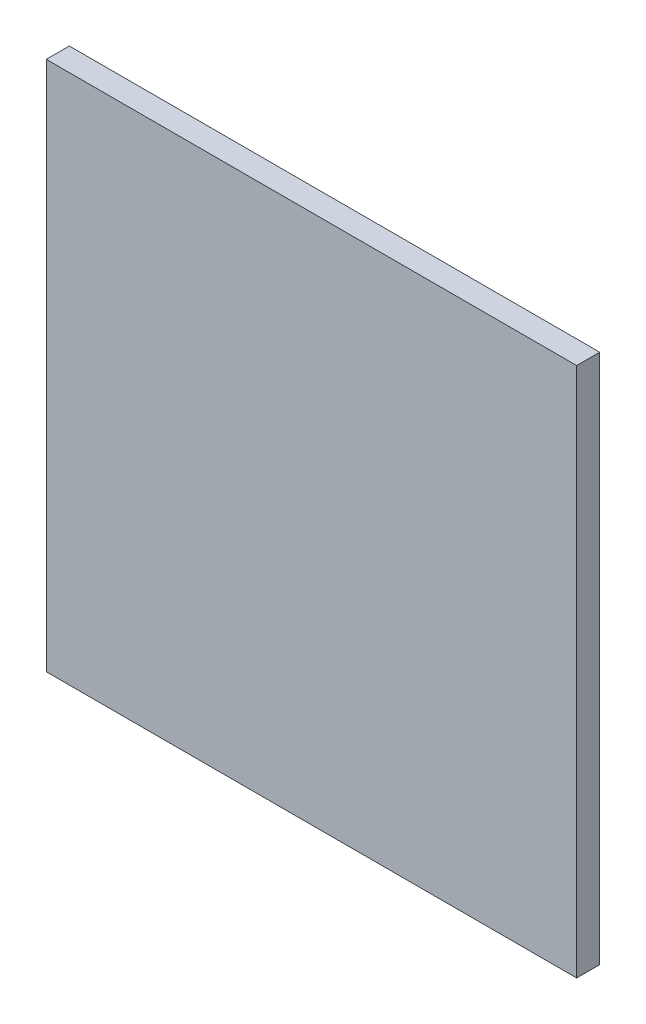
from build123d import *

# Parameters (mm, degrees)
SKETCH_1_W      = 184
SKETCH_1_H      = 184
EXTRUDE_1_DEPTH = 8


with BuildPart() as part:
    # Sketch 1 → Extrude 1 (new body)
    with BuildSketch(Plane.XY):
        Rectangle(SKETCH_1_W, SKETCH_1_H)
    extrude(amount=EXTRUDE_1_DEPTH)


solid = part.part
